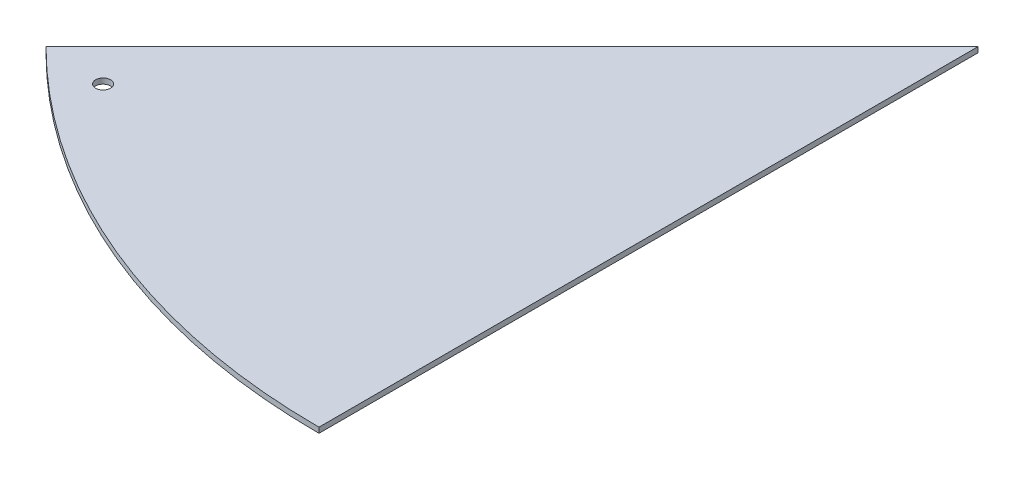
from build123d import *

# Parameters (mm, degrees)
BOSS_EXTRUDE1_DEPTH = 20
SKETCH3_R           = 27.5
CUT_EXTRUDE1_DEPTH  = 3001.691586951


with BuildPart() as part:
    # Sketch2 → Boss-Extrude1 (new body)
    with BuildSketch(Plane(origin=(0, 0, 0), x_dir=(1, 0, 0), z_dir=(0, 1, 0))):
        with BuildLine():
            Line((0, 0), (0, -2450))
            ThreePointArc((0, -2450), (-937.574409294, -2263.504854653), (-1732.411613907, -1732.411613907))
            Line((-1732.411613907, -1732.411613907), (0, 0))
        make_face()
    extrude(amount=BOSS_EXTRUDE1_DEPTH)

    # Sketch3 → Cut-Extrude1 (cut, through all)
    with BuildSketch(Plane(origin=(0, 20, 0), x_dir=(1, 0, 0), z_dir=(0, 1, 0))):
        with Locations(Location((-1506.137443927, -1746.553749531, 0), (0, 0, 270))):
            Circle(SKETCH3_R)
    extrude(amount=-CUT_EXTRUDE1_DEPTH, mode=Mode.SUBTRACT)


solid = part.part
